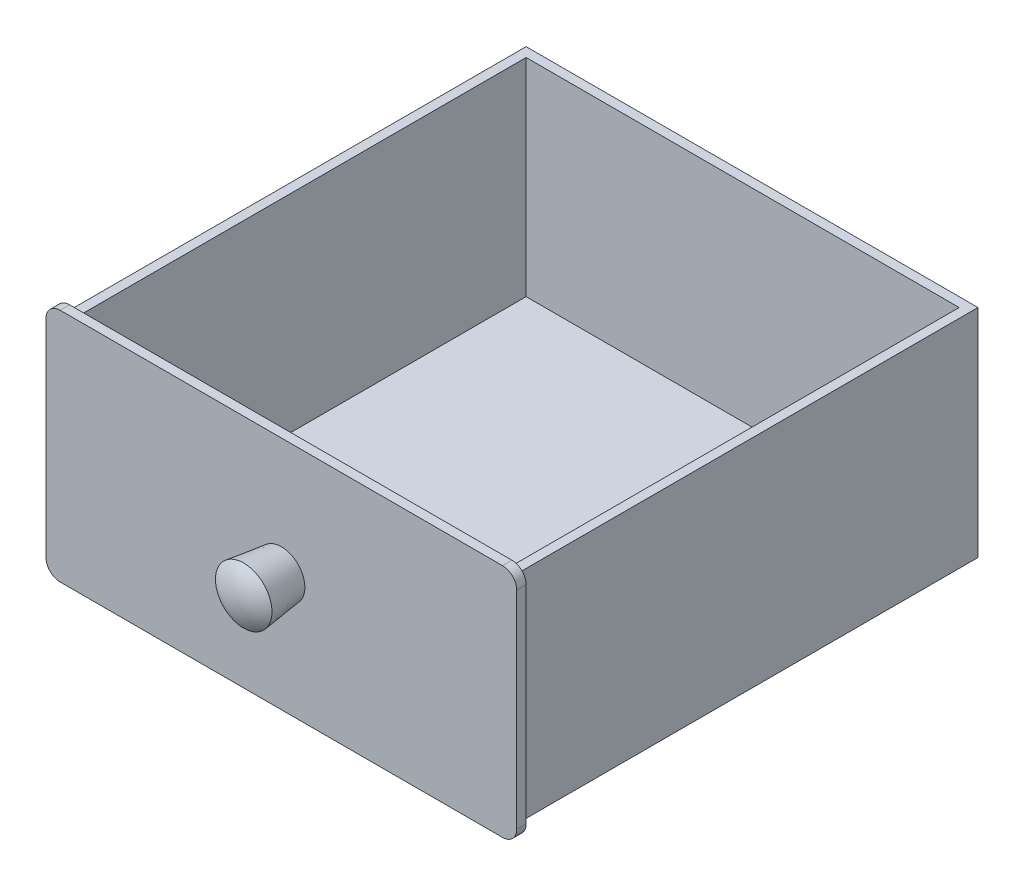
from build123d import *

# Parameters (mm, degrees)
SKETCH_1_W      = 96
SKETCH_1_H      = 98
EXTRUDE_1_DEPTH = 46
SHELL_1_T       = -2
SKETCH_2_W      = 100
SKETCH_2_H      = 50
EXTRUDE_2_DEPTH = 2
FILLET_1_R      = 3


with BuildPart() as part:
    # Sketch 1 → Extrude 1 (new body)
    with BuildSketch(Plane(origin=(0, 0, 0), x_dir=(1, 0, 0), z_dir=(0, 1, 0))):
        Rectangle(SKETCH_1_W, SKETCH_1_H)
    extrude(amount=EXTRUDE_1_DEPTH)

    # Shell 1
    shell_1_openings = [part.faces().sort_by_distance(p)[0] for p in [
        (0, 46, 0),
        (0, 23, 49),
    ]]
    offset(amount=SHELL_1_T, openings=shell_1_openings, kind=Kind.INTERSECTION)

    # Sketch 2 → Extrude 2 (add)
    with BuildSketch(Plane.XY.offset(49)):
        with Locations((0, 23)):
            Rectangle(SKETCH_2_W, SKETCH_2_H)
    extrude(amount=EXTRUDE_2_DEPTH)

    # Sketch 3 → Revolve 1 (revolve)
    with BuildSketch(Plane(origin=(0, 0, 0), x_dir=(0, 0, -1), z_dir=(1, 0, 0))):
        with BuildLine():
            Line((-51, 23), (-61, 23))
            ThreePointArc((-61, 23), (-60.486832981, 26.16227766), (-59, 29))
            Line((-59, 29), (-51, 28))
            Line((-51, 28), (-51, 23))
        make_face()
    revolve(axis=Axis((0, 23, 51), (0, 0, 1)))

    # Fillet 1
    fillet_1_edges = [part.edges().sort_by_distance(p)[0] for p in [
        (-50, 48, 50),
        (-50, -2, 50),
        (50, -2, 50),
        (50, 48, 50),
    ]]
    fillet(fillet_1_edges, radius=FILLET_1_R)


solid = part.part
